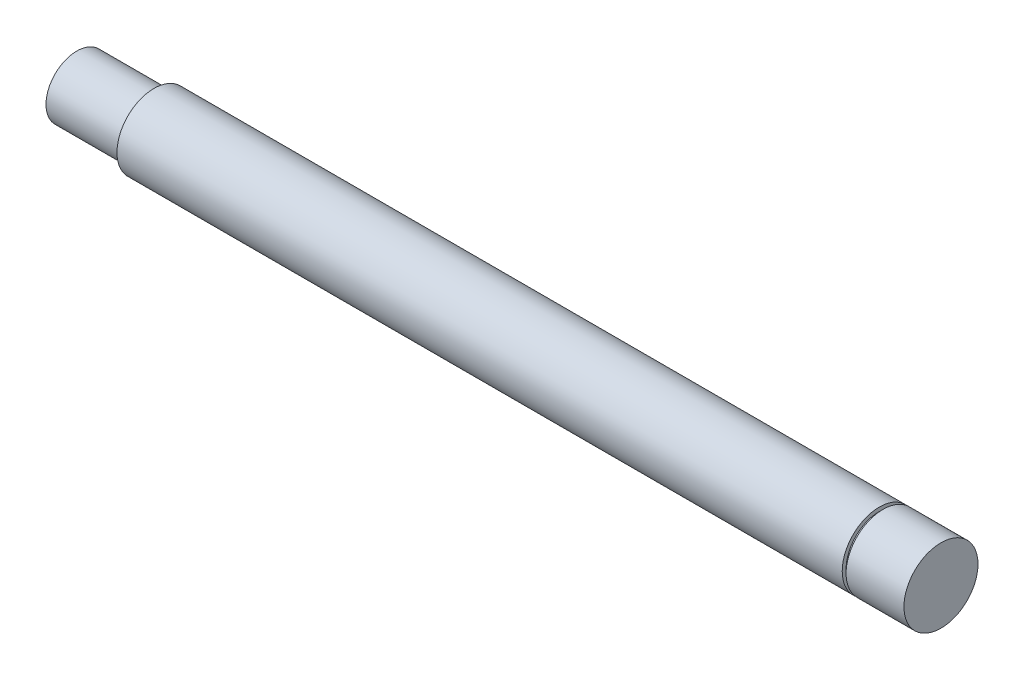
from build123d import *

# Parameters (mm, degrees)
SKETCH1_R          = 7.62
BASE_EXTRUDE_DEPTH = 177.8
CUT_EXTRUDE1_START = -0.79375
SKETCH2_R          = 7.62
SKETCH2_R_2        = 6.82625
CUT_EXTRUDE1_DEPTH = 0.79375
SKETCH3_R          = 7.62
SKETCH3_R_2        = 6.35
CUT_EXTRUDE2_DEPTH = 15.875


with BuildPart() as part:
    # Sketch1 → Base-Extrude (new body)
    with BuildSketch(Plane(origin=(0, 0, 0), x_dir=(0, 0, -1), z_dir=(1, 0, 0))):
        Circle(SKETCH1_R)
    extrude(amount=BASE_EXTRUDE_DEPTH)

    # Sketch2 → Cut-Extrude1 (cut)
    with BuildSketch(Plane(origin=(165.89375, 0, 0), x_dir=(0, 0, -1), z_dir=(1, 0, 0)).offset(CUT_EXTRUDE1_START)):
        Circle(SKETCH2_R)
        Circle(SKETCH2_R_2, mode=Mode.SUBTRACT)
    extrude(amount=CUT_EXTRUDE1_DEPTH, mode=Mode.SUBTRACT)

    # Sketch3 → Cut-Extrude2 (cut)
    with BuildSketch(Plane.ZY):
        Circle(SKETCH3_R)
        Circle(SKETCH3_R_2, mode=Mode.SUBTRACT)
    extrude(amount=-CUT_EXTRUDE2_DEPTH, mode=Mode.SUBTRACT)


solid = part.part
